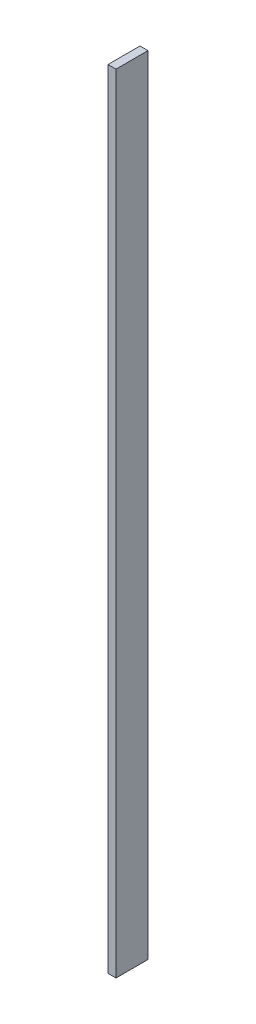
from build123d import *

# Parameters (mm, degrees)
SKETCH1_W           = 25.4
SKETCH1_H           = 624.84
BOSS_EXTRUDE1_DEPTH = 6.35


with BuildPart() as part:
    # Sketch1 → Boss-Extrude1 (new body)
    with BuildSketch(Plane(origin=(0, 0, 0), x_dir=(0, 0, -1), z_dir=(1, 0, 0))):
        with Locations((12.7, -312.42)):
            Rectangle(SKETCH1_W, SKETCH1_H)
    extrude(amount=BOSS_EXTRUDE1_DEPTH)


solid = part.part
